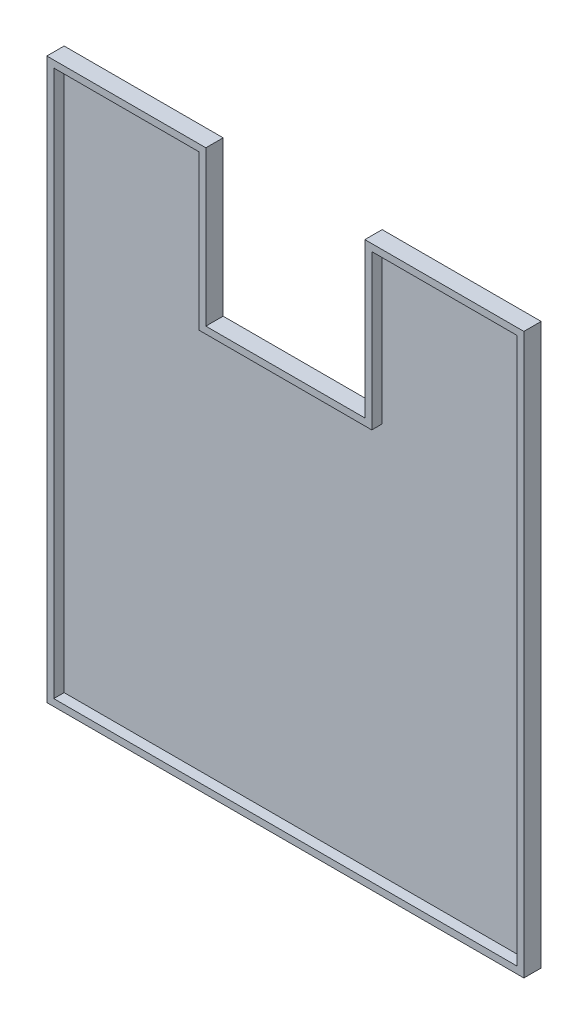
ISO-10303-21;
HEADER;
FILE_DESCRIPTION(('STEP AP214'),'2;1');
FILE_NAME('part.step','',(''),(''),'','','');
FILE_SCHEMA(('AUTOMOTIVE_DESIGN { 1 0 10303 214 1 1 1 1 }'));
ENDSEC;
DATA;
#1=APPLICATION_CONTEXT('core data for automotive mechanical design processes');
#2=APPLICATION_PROTOCOL_DEFINITION('international standard','automotive_design',2000,#1);
#3=PRODUCT_CONTEXT('',#1,'mechanical');
#4=PRODUCT('Part','Part','',(#3));
#5=PRODUCT_RELATED_PRODUCT_CATEGORY('part','',(#4));
#6=PRODUCT_DEFINITION_FORMATION('','',#4);
#7=PRODUCT_DEFINITION_CONTEXT('part definition',#1,'design');
#8=PRODUCT_DEFINITION('design','',#6,#7);
#9=PRODUCT_DEFINITION_SHAPE('','',#8);
#10=(LENGTH_UNIT() NAMED_UNIT(*) SI_UNIT(.MILLI.,.METRE.));
#11=(NAMED_UNIT(*) PLANE_ANGLE_UNIT() SI_UNIT($,.RADIAN.));
#12=(NAMED_UNIT(*) SI_UNIT($,.STERADIAN.) SOLID_ANGLE_UNIT());
#13=UNCERTAINTY_MEASURE_WITH_UNIT(LENGTH_MEASURE(1.E-05),#10,'distance_accuracy_value','');
#14=(GEOMETRIC_REPRESENTATION_CONTEXT(3) GLOBAL_UNCERTAINTY_ASSIGNED_CONTEXT((#13)) GLOBAL_UNIT_ASSIGNED_CONTEXT((#10,
#11,#12)) REPRESENTATION_CONTEXT('',''));
#15=CARTESIAN_POINT('',(0.,0.,0.));
#16=DIRECTION('',(0.,0.,1.));
#17=DIRECTION('',(1.,0.,0.));
#18=AXIS2_PLACEMENT_3D('',#15,#16,#17);
#19=CARTESIAN_POINT('',(0.,0.,0.));
#20=DIRECTION('',(0.,0.,1.));
#21=DIRECTION('',(1.,0.,0.));
#22=AXIS2_PLACEMENT_3D('',#19,#20,#21);
#23=PLANE('',#22);
#24=DIRECTION('',(-1.,0.,0.));
#25=VECTOR('',#24,1.);
#26=CARTESIAN_POINT('',(-23.,81.,0.));
#27=LINE('',#26,#25);
#28=CARTESIAN_POINT('',(-23.,81.,0.));
#29=VERTEX_POINT('',#28);
#30=CARTESIAN_POINT('',(-69.,81.,0.));
#31=VERTEX_POINT('',#30);
#32=EDGE_CURVE('E212',#29,#31,#27,.T.);
#33=ORIENTED_EDGE('',*,*,#32,.F.);
#34=DIRECTION('',(0.,1.,0.));
#35=VECTOR('',#34,1.);
#36=CARTESIAN_POINT('',(-23.,36.311907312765,0.));
#37=LINE('',#36,#35);
#38=CARTESIAN_POINT('',(-23.,36.311907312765,0.));
#39=VERTEX_POINT('',#38);
#40=EDGE_CURVE('E243',#39,#29,#37,.T.);
#41=ORIENTED_EDGE('',*,*,#40,.F.);
#42=DIRECTION('',(-1.,0.,0.));
#43=VECTOR('',#42,1.);
#44=CARTESIAN_POINT('',(23.,36.311907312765,0.));
#45=LINE('',#44,#43);
#46=CARTESIAN_POINT('',(23.,36.311907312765,0.));
#47=VERTEX_POINT('',#46);
#48=EDGE_CURVE('E240',#47,#39,#45,.T.);
#49=ORIENTED_EDGE('',*,*,#48,.F.);
#50=DIRECTION('',(0.,-1.,0.));
#51=VECTOR('',#50,1.);
#52=CARTESIAN_POINT('',(23.,81.,0.));
#53=LINE('',#52,#51);
#54=CARTESIAN_POINT('',(23.,81.,0.));
#55=VERTEX_POINT('',#54);
#56=EDGE_CURVE('E237',#55,#47,#53,.T.);
#57=ORIENTED_EDGE('',*,*,#56,.F.);
#58=DIRECTION('',(-1.,0.,0.));
#59=VECTOR('',#58,1.);
#60=CARTESIAN_POINT('',(69.,81.,0.));
#61=LINE('',#60,#59);
#62=CARTESIAN_POINT('',(69.,81.,0.));
#63=VERTEX_POINT('',#62);
#64=EDGE_CURVE('E234',#63,#55,#61,.T.);
#65=ORIENTED_EDGE('',*,*,#64,.F.);
#66=DIRECTION('',(0.,1.,0.));
#67=VECTOR('',#66,1.);
#68=CARTESIAN_POINT('',(69.,-81.,0.));
#69=LINE('',#68,#67);
#70=CARTESIAN_POINT('',(69.,-81.,0.));
#71=VERTEX_POINT('',#70);
#72=EDGE_CURVE('E231',#71,#63,#69,.T.);
#73=ORIENTED_EDGE('',*,*,#72,.F.);
#74=DIRECTION('',(1.,0.,0.));
#75=VECTOR('',#74,1.);
#76=CARTESIAN_POINT('',(-69.,-81.,0.));
#77=LINE('',#76,#75);
#78=CARTESIAN_POINT('',(-69.,-81.,0.));
#79=VERTEX_POINT('',#78);
#80=EDGE_CURVE('E228',#79,#71,#77,.T.);
#81=ORIENTED_EDGE('',*,*,#80,.F.);
#82=DIRECTION('',(0.,-1.,0.));
#83=VECTOR('',#82,1.);
#84=CARTESIAN_POINT('',(-69.,81.,0.));
#85=LINE('',#84,#83);
#86=EDGE_CURVE('E225',#31,#79,#85,.T.);
#87=ORIENTED_EDGE('',*,*,#86,.F.);
#88=EDGE_LOOP('',(#33,#41,#49,#57,#65,#73,#81,#87));
#89=FACE_BOUND('',#88,.T.);
#90=ADVANCED_FACE('F39',(#89),#23,.F.);
#91=CARTESIAN_POINT('',(-23.,36.311907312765,0.));
#92=DIRECTION('',(1.,0.,0.));
#93=DIRECTION('',(0.,0.,-1.));
#94=AXIS2_PLACEMENT_3D('',#91,#92,#93);
#95=PLANE('',#94);
#96=DIRECTION('',(0.,0.,1.));
#97=VECTOR('',#96,1.);
#98=CARTESIAN_POINT('',(-23.,81.,0.));
#99=LINE('',#98,#97);
#100=CARTESIAN_POINT('',(-23.,81.,5.));
#101=VERTEX_POINT('',#100);
#102=EDGE_CURVE('E247',#29,#101,#99,.T.);
#103=ORIENTED_EDGE('',*,*,#102,.T.);
#104=DIRECTION('',(0.,1.,0.));
#105=VECTOR('',#104,1.);
#106=CARTESIAN_POINT('',(-23.,36.311907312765,5.));
#107=LINE('',#106,#105);
#108=CARTESIAN_POINT('',(-23.,36.311907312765,5.));
#109=VERTEX_POINT('',#108);
#110=EDGE_CURVE('E157',#109,#101,#107,.T.);
#111=ORIENTED_EDGE('',*,*,#110,.F.);
#112=DIRECTION('',(0.,0.,1.));
#113=VECTOR('',#112,1.);
#114=CARTESIAN_POINT('',(-23.,36.311907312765,0.));
#115=LINE('',#114,#113);
#116=EDGE_CURVE('E250',#39,#109,#115,.T.);
#117=ORIENTED_EDGE('',*,*,#116,.F.);
#118=ORIENTED_EDGE('',*,*,#40,.T.);
#119=EDGE_LOOP('',(#103,#111,#117,#118));
#120=FACE_BOUND('',#119,.T.);
#121=ADVANCED_FACE('F307',(#120),#95,.T.);
#122=CARTESIAN_POINT('',(23.,36.311907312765,0.));
#123=DIRECTION('',(0.,1.,0.));
#124=DIRECTION('',(-1.,0.,0.));
#125=AXIS2_PLACEMENT_3D('',#122,#123,#124);
#126=PLANE('',#125);
#127=ORIENTED_EDGE('',*,*,#116,.T.);
#128=DIRECTION('',(-1.,0.,0.));
#129=VECTOR('',#128,1.);
#130=CARTESIAN_POINT('',(23.,36.311907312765,5.));
#131=LINE('',#130,#129);
#132=CARTESIAN_POINT('',(23.,36.311907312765,5.));
#133=VERTEX_POINT('',#132);
#134=EDGE_CURVE('E206',#133,#109,#131,.T.);
#135=ORIENTED_EDGE('',*,*,#134,.F.);
#136=DIRECTION('',(0.,0.,1.));
#137=VECTOR('',#136,1.);
#138=CARTESIAN_POINT('',(23.,36.311907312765,0.));
#139=LINE('',#138,#137);
#140=EDGE_CURVE('E252',#47,#133,#139,.T.);
#141=ORIENTED_EDGE('',*,*,#140,.F.);
#142=ORIENTED_EDGE('',*,*,#48,.T.);
#143=EDGE_LOOP('',(#127,#135,#141,#142));
#144=FACE_BOUND('',#143,.T.);
#145=ADVANCED_FACE('F312',(#144),#126,.T.);
#146=CARTESIAN_POINT('',(23.,81.,0.));
#147=DIRECTION('',(-1.,0.,0.));
#148=DIRECTION('',(0.,-1.,0.));
#149=AXIS2_PLACEMENT_3D('',#146,#147,#148);
#150=PLANE('',#149);
#151=ORIENTED_EDGE('',*,*,#140,.T.);
#152=DIRECTION('',(0.,-1.,0.));
#153=VECTOR('',#152,1.);
#154=CARTESIAN_POINT('',(23.,81.,5.));
#155=LINE('',#154,#153);
#156=CARTESIAN_POINT('',(23.,81.,5.));
#157=VERTEX_POINT('',#156);
#158=EDGE_CURVE('E203',#157,#133,#155,.T.);
#159=ORIENTED_EDGE('',*,*,#158,.F.);
#160=DIRECTION('',(0.,0.,1.));
#161=VECTOR('',#160,1.);
#162=CARTESIAN_POINT('',(23.,81.,0.));
#163=LINE('',#162,#161);
#164=EDGE_CURVE('E254',#55,#157,#163,.T.);
#165=ORIENTED_EDGE('',*,*,#164,.F.);
#166=ORIENTED_EDGE('',*,*,#56,.T.);
#167=EDGE_LOOP('',(#151,#159,#165,#166));
#168=FACE_BOUND('',#167,.T.);
#169=ADVANCED_FACE('F328',(#168),#150,.T.);
#170=CARTESIAN_POINT('',(69.,81.,0.));
#171=DIRECTION('',(0.,1.,0.));
#172=DIRECTION('',(0.,0.,1.));
#173=AXIS2_PLACEMENT_3D('',#170,#171,#172);
#174=PLANE('',#173);
#175=ORIENTED_EDGE('',*,*,#164,.T.);
#176=DIRECTION('',(-1.,0.,0.));
#177=VECTOR('',#176,1.);
#178=CARTESIAN_POINT('',(69.,81.,5.));
#179=LINE('',#178,#177);
#180=CARTESIAN_POINT('',(69.,81.,5.));
#181=VERTEX_POINT('',#180);
#182=EDGE_CURVE('E200',#181,#157,#179,.T.);
#183=ORIENTED_EDGE('',*,*,#182,.F.);
#184=DIRECTION('',(0.,0.,1.));
#185=VECTOR('',#184,1.);
#186=CARTESIAN_POINT('',(69.,81.,0.));
#187=LINE('',#186,#185);
#188=EDGE_CURVE('E256',#63,#181,#187,.T.);
#189=ORIENTED_EDGE('',*,*,#188,.F.);
#190=ORIENTED_EDGE('',*,*,#64,.T.);
#191=EDGE_LOOP('',(#175,#183,#189,#190));
#192=FACE_BOUND('',#191,.T.);
#193=ADVANCED_FACE('F332',(#192),#174,.T.);
#194=CARTESIAN_POINT('',(69.,-81.,0.));
#195=DIRECTION('',(1.,0.,0.));
#196=DIRECTION('',(0.,1.,0.));
#197=AXIS2_PLACEMENT_3D('',#194,#195,#196);
#198=PLANE('',#197);
#199=ORIENTED_EDGE('',*,*,#188,.T.);
#200=DIRECTION('',(0.,1.,0.));
#201=VECTOR('',#200,1.);
#202=CARTESIAN_POINT('',(69.,-81.,5.));
#203=LINE('',#202,#201);
#204=CARTESIAN_POINT('',(69.,-81.,5.));
#205=VERTEX_POINT('',#204);
#206=EDGE_CURVE('E197',#205,#181,#203,.T.);
#207=ORIENTED_EDGE('',*,*,#206,.F.);
#208=DIRECTION('',(0.,0.,1.));
#209=VECTOR('',#208,1.);
#210=CARTESIAN_POINT('',(69.,-81.,0.));
#211=LINE('',#210,#209);
#212=EDGE_CURVE('E258',#71,#205,#211,.T.);
#213=ORIENTED_EDGE('',*,*,#212,.F.);
#214=ORIENTED_EDGE('',*,*,#72,.T.);
#215=EDGE_LOOP('',(#199,#207,#213,#214));
#216=FACE_BOUND('',#215,.T.);
#217=ADVANCED_FACE('F337',(#216),#198,.T.);
#218=CARTESIAN_POINT('',(-69.,-81.,0.));
#219=DIRECTION('',(0.,-1.,0.));
#220=DIRECTION('',(0.,0.,-1.));
#221=AXIS2_PLACEMENT_3D('',#218,#219,#220);
#222=PLANE('',#221);
#223=ORIENTED_EDGE('',*,*,#212,.T.);
#224=DIRECTION('',(1.,0.,0.));
#225=VECTOR('',#224,1.);
#226=CARTESIAN_POINT('',(-69.,-81.,5.));
#227=LINE('',#226,#225);
#228=CARTESIAN_POINT('',(-69.,-81.,5.));
#229=VERTEX_POINT('',#228);
#230=EDGE_CURVE('E194',#229,#205,#227,.T.);
#231=ORIENTED_EDGE('',*,*,#230,.F.);
#232=DIRECTION('',(0.,0.,1.));
#233=VECTOR('',#232,1.);
#234=CARTESIAN_POINT('',(-69.,-81.,0.));
#235=LINE('',#234,#233);
#236=EDGE_CURVE('E260',#79,#229,#235,.T.);
#237=ORIENTED_EDGE('',*,*,#236,.F.);
#238=ORIENTED_EDGE('',*,*,#80,.T.);
#239=EDGE_LOOP('',(#223,#231,#237,#238));
#240=FACE_BOUND('',#239,.T.);
#241=ADVANCED_FACE('F340',(#240),#222,.T.);
#242=CARTESIAN_POINT('',(-69.,81.,0.));
#243=DIRECTION('',(-1.,0.,0.));
#244=DIRECTION('',(0.,-1.,0.));
#245=AXIS2_PLACEMENT_3D('',#242,#243,#244);
#246=PLANE('',#245);
#247=ORIENTED_EDGE('',*,*,#236,.T.);
#248=DIRECTION('',(0.,-1.,0.));
#249=VECTOR('',#248,1.);
#250=CARTESIAN_POINT('',(-69.,81.,5.));
#251=LINE('',#250,#249);
#252=CARTESIAN_POINT('',(-69.,81.,5.));
#253=VERTEX_POINT('',#252);
#254=EDGE_CURVE('E191',#253,#229,#251,.T.);
#255=ORIENTED_EDGE('',*,*,#254,.F.);
#256=DIRECTION('',(0.,0.,1.));
#257=VECTOR('',#256,1.);
#258=CARTESIAN_POINT('',(-69.,81.,0.));
#259=LINE('',#258,#257);
#260=EDGE_CURVE('E246',#31,#253,#259,.T.);
#261=ORIENTED_EDGE('',*,*,#260,.F.);
#262=ORIENTED_EDGE('',*,*,#86,.T.);
#263=EDGE_LOOP('',(#247,#255,#261,#262));
#264=FACE_BOUND('',#263,.T.);
#265=ADVANCED_FACE('F343',(#264),#246,.T.);
#266=CARTESIAN_POINT('',(-27.,81.,0.));
#267=DIRECTION('',(0.,1.,0.));
#268=DIRECTION('',(0.,0.,1.));
#269=AXIS2_PLACEMENT_3D('',#266,#267,#268);
#270=PLANE('',#269);
#271=ORIENTED_EDGE('',*,*,#260,.T.);
#272=DIRECTION('',(-1.,0.,0.));
#273=VECTOR('',#272,1.);
#274=CARTESIAN_POINT('',(-23.,81.,5.));
#275=LINE('',#274,#273);
#276=EDGE_CURVE('E188',#101,#253,#275,.T.);
#277=ORIENTED_EDGE('',*,*,#276,.F.);
#278=ORIENTED_EDGE('',*,*,#102,.F.);
#279=ORIENTED_EDGE('',*,*,#32,.T.);
#280=EDGE_LOOP('',(#271,#277,#278,#279));
#281=FACE_BOUND('',#280,.T.);
#282=ADVANCED_FACE('F345',(#281),#270,.T.);
#283=CARTESIAN_POINT('',(-25.,34.510337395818,0.));
#284=DIRECTION('',(1.,3.49689613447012E-13,0.));
#285=DIRECTION('',(-3.49689613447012E-13,1.,0.));
#286=AXIS2_PLACEMENT_3D('',#283,#284,#285);
#287=PLANE('',#286);
#288=DIRECTION('',(0.,1.,0.));
#289=VECTOR('',#288,1.);
#290=CARTESIAN_POINT('',(-25.,79.,2.));
#291=LINE('',#290,#289);
#292=CARTESIAN_POINT('',(-24.9999999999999,34.311907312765,2.));
#293=VERTEX_POINT('',#292);
#294=CARTESIAN_POINT('',(-25.,79.,2.));
#295=VERTEX_POINT('',#294);
#296=EDGE_CURVE('E61',#293,#295,#291,.T.);
#297=ORIENTED_EDGE('',*,*,#296,.F.);
#298=DIRECTION('',(0.,0.,1.));
#299=VECTOR('',#298,1.);
#300=CARTESIAN_POINT('',(-24.9999999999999,34.311907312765,0.));
#301=LINE('',#300,#299);
#302=CARTESIAN_POINT('',(-24.9999999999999,34.311907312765,5.));
#303=VERTEX_POINT('',#302);
#304=EDGE_CURVE('E162',#293,#303,#301,.T.);
#305=ORIENTED_EDGE('',*,*,#304,.T.);
#306=DIRECTION('',(0.,1.,0.));
#307=VECTOR('',#306,1.);
#308=CARTESIAN_POINT('',(-25.,34.510337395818,5.));
#309=LINE('',#308,#307);
#310=CARTESIAN_POINT('',(-25.,79.,5.));
#311=VERTEX_POINT('',#310);
#312=EDGE_CURVE('E160',#303,#311,#309,.T.);
#313=ORIENTED_EDGE('',*,*,#312,.T.);
#314=DIRECTION('',(0.,0.,1.));
#315=VECTOR('',#314,1.);
#316=CARTESIAN_POINT('',(-25.,79.,0.));
#317=LINE('',#316,#315);
#318=EDGE_CURVE('E149',#295,#311,#317,.T.);
#319=ORIENTED_EDGE('',*,*,#318,.F.);
#320=EDGE_LOOP('',(#297,#305,#313,#319));
#321=FACE_BOUND('',#320,.T.);
#322=ADVANCED_FACE('F161',(#321),#287,.F.);
#323=CARTESIAN_POINT('',(-24.9999999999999,34.311907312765,0.));
#324=DIRECTION('',(0.,1.,0.));
#325=DIRECTION('',(0.,0.,1.));
#326=AXIS2_PLACEMENT_3D('',#323,#324,#325);
#327=PLANE('',#326);
#328=DIRECTION('',(-1.,0.,0.));
#329=VECTOR('',#328,1.);
#330=CARTESIAN_POINT('',(0.,34.311907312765,2.));
#331=LINE('',#330,#329);
#332=CARTESIAN_POINT('',(25.0000000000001,34.311907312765,2.));
#333=VERTEX_POINT('',#332);
#334=EDGE_CURVE('E249',#333,#293,#331,.T.);
#335=ORIENTED_EDGE('',*,*,#334,.F.);
#336=DIRECTION('',(0.,0.,1.));
#337=VECTOR('',#336,1.);
#338=CARTESIAN_POINT('',(25.0000000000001,34.311907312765,0.));
#339=LINE('',#338,#337);
#340=CARTESIAN_POINT('',(25.0000000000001,34.311907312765,5.));
#341=VERTEX_POINT('',#340);
#342=EDGE_CURVE('E213',#333,#341,#339,.T.);
#343=ORIENTED_EDGE('',*,*,#342,.T.);
#344=DIRECTION('',(-1.,0.,0.));
#345=VECTOR('',#344,1.);
#346=CARTESIAN_POINT('',(-24.9999999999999,34.311907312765,5.));
#347=LINE('',#346,#345);
#348=EDGE_CURVE('E186',#341,#303,#347,.T.);
#349=ORIENTED_EDGE('',*,*,#348,.T.);
#350=ORIENTED_EDGE('',*,*,#304,.F.);
#351=EDGE_LOOP('',(#335,#343,#349,#350));
#352=FACE_BOUND('',#351,.T.);
#353=ADVANCED_FACE('F296',(#352),#327,.F.);
#354=CARTESIAN_POINT('',(25.0000000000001,34.311907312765,0.));
#355=DIRECTION('',(-1.,-3.49689613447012E-13,0.));
#356=DIRECTION('',(3.49689613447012E-13,-1.,0.));
#357=AXIS2_PLACEMENT_3D('',#354,#355,#356);
#358=PLANE('',#357);
#359=DIRECTION('',(0.,-1.,0.));
#360=VECTOR('',#359,1.);
#361=CARTESIAN_POINT('',(25.,34.510337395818,2.));
#362=LINE('',#361,#360);
#363=CARTESIAN_POINT('',(25.,79.,2.));
#364=VERTEX_POINT('',#363);
#365=EDGE_CURVE('E268',#364,#333,#362,.T.);
#366=ORIENTED_EDGE('',*,*,#365,.F.);
#367=DIRECTION('',(0.,0.,1.));
#368=VECTOR('',#367,1.);
#369=CARTESIAN_POINT('',(25.,79.,0.));
#370=LINE('',#369,#368);
#371=CARTESIAN_POINT('',(25.,79.,5.));
#372=VERTEX_POINT('',#371);
#373=EDGE_CURVE('E215',#364,#372,#370,.T.);
#374=ORIENTED_EDGE('',*,*,#373,.T.);
#375=DIRECTION('',(0.,-1.,0.));
#376=VECTOR('',#375,1.);
#377=CARTESIAN_POINT('',(25.,79.,5.));
#378=LINE('',#377,#376);
#379=EDGE_CURVE('E183',#372,#341,#378,.T.);
#380=ORIENTED_EDGE('',*,*,#379,.T.);
#381=ORIENTED_EDGE('',*,*,#342,.F.);
#382=EDGE_LOOP('',(#366,#374,#380,#381));
#383=FACE_BOUND('',#382,.T.);
#384=ADVANCED_FACE('F297',(#383),#358,.F.);
#385=CARTESIAN_POINT('',(67.,79.,0.));
#386=DIRECTION('',(0.,1.,0.));
#387=DIRECTION('',(0.,0.,1.));
#388=AXIS2_PLACEMENT_3D('',#385,#386,#387);
#389=PLANE('',#388);
#390=DIRECTION('',(-1.,0.,0.));
#391=VECTOR('',#390,1.);
#392=CARTESIAN_POINT('',(25.,79.,2.));
#393=LINE('',#392,#391);
#394=CARTESIAN_POINT('',(67.,79.,2.));
#395=VERTEX_POINT('',#394);
#396=EDGE_CURVE('E265',#395,#364,#393,.T.);
#397=ORIENTED_EDGE('',*,*,#396,.F.);
#398=DIRECTION('',(0.,0.,1.));
#399=VECTOR('',#398,1.);
#400=CARTESIAN_POINT('',(67.,79.,0.));
#401=LINE('',#400,#399);
#402=CARTESIAN_POINT('',(67.,79.,5.));
#403=VERTEX_POINT('',#402);
#404=EDGE_CURVE('E217',#395,#403,#401,.T.);
#405=ORIENTED_EDGE('',*,*,#404,.T.);
#406=DIRECTION('',(-1.,0.,0.));
#407=VECTOR('',#406,1.);
#408=CARTESIAN_POINT('',(67.,79.,5.));
#409=LINE('',#408,#407);
#410=EDGE_CURVE('E180',#403,#372,#409,.T.);
#411=ORIENTED_EDGE('',*,*,#410,.T.);
#412=ORIENTED_EDGE('',*,*,#373,.F.);
#413=EDGE_LOOP('',(#397,#405,#411,#412));
#414=FACE_BOUND('',#413,.T.);
#415=ADVANCED_FACE('F290',(#414),#389,.F.);
#416=CARTESIAN_POINT('',(67.,-79.,0.));
#417=DIRECTION('',(1.,0.,0.));
#418=DIRECTION('',(0.,0.,-1.));
#419=AXIS2_PLACEMENT_3D('',#416,#417,#418);
#420=PLANE('',#419);
#421=DIRECTION('',(0.,1.,0.));
#422=VECTOR('',#421,1.);
#423=CARTESIAN_POINT('',(67.,-79.,2.));
#424=LINE('',#423,#422);
#425=CARTESIAN_POINT('',(67.,-79.,2.));
#426=VERTEX_POINT('',#425);
#427=EDGE_CURVE('E11',#426,#395,#424,.T.);
#428=ORIENTED_EDGE('',*,*,#427,.F.);
#429=DIRECTION('',(0.,0.,1.));
#430=VECTOR('',#429,1.);
#431=CARTESIAN_POINT('',(67.,-79.,0.));
#432=LINE('',#431,#430);
#433=CARTESIAN_POINT('',(67.,-79.,5.));
#434=VERTEX_POINT('',#433);
#435=EDGE_CURVE('E219',#426,#434,#432,.T.);
#436=ORIENTED_EDGE('',*,*,#435,.T.);
#437=DIRECTION('',(0.,1.,0.));
#438=VECTOR('',#437,1.);
#439=CARTESIAN_POINT('',(67.,-79.,5.));
#440=LINE('',#439,#438);
#441=EDGE_CURVE('E177',#434,#403,#440,.T.);
#442=ORIENTED_EDGE('',*,*,#441,.T.);
#443=ORIENTED_EDGE('',*,*,#404,.F.);
#444=EDGE_LOOP('',(#428,#436,#442,#443));
#445=FACE_BOUND('',#444,.T.);
#446=ADVANCED_FACE('F288',(#445),#420,.F.);
#447=CARTESIAN_POINT('',(-67.,-79.,0.));
#448=DIRECTION('',(0.,-1.,0.));
#449=DIRECTION('',(0.,0.,-1.));
#450=AXIS2_PLACEMENT_3D('',#447,#448,#449);
#451=PLANE('',#450);
#452=DIRECTION('',(1.,0.,0.));
#453=VECTOR('',#452,1.);
#454=CARTESIAN_POINT('',(-67.,-79.,2.));
#455=LINE('',#454,#453);
#456=CARTESIAN_POINT('',(-67.,-79.,2.));
#457=VERTEX_POINT('',#456);
#458=EDGE_CURVE('E46',#457,#426,#455,.T.);
#459=ORIENTED_EDGE('',*,*,#458,.F.);
#460=DIRECTION('',(0.,0.,1.));
#461=VECTOR('',#460,1.);
#462=CARTESIAN_POINT('',(-67.,-79.,0.));
#463=LINE('',#462,#461);
#464=CARTESIAN_POINT('',(-67.,-79.,5.));
#465=VERTEX_POINT('',#464);
#466=EDGE_CURVE('E221',#457,#465,#463,.T.);
#467=ORIENTED_EDGE('',*,*,#466,.T.);
#468=DIRECTION('',(1.,0.,0.));
#469=VECTOR('',#468,1.);
#470=CARTESIAN_POINT('',(-67.,-79.,5.));
#471=LINE('',#470,#469);
#472=EDGE_CURVE('E172',#465,#434,#471,.T.);
#473=ORIENTED_EDGE('',*,*,#472,.T.);
#474=ORIENTED_EDGE('',*,*,#435,.F.);
#475=EDGE_LOOP('',(#459,#467,#473,#474));
#476=FACE_BOUND('',#475,.T.);
#477=ADVANCED_FACE('F280',(#476),#451,.F.);
#478=CARTESIAN_POINT('',(-67.,79.,0.));
#479=DIRECTION('',(-1.,0.,0.));
#480=DIRECTION('',(0.,0.,1.));
#481=AXIS2_PLACEMENT_3D('',#478,#479,#480);
#482=PLANE('',#481);
#483=DIRECTION('',(0.,-1.,0.));
#484=VECTOR('',#483,1.);
#485=CARTESIAN_POINT('',(-67.,-79.,2.));
#486=LINE('',#485,#484);
#487=CARTESIAN_POINT('',(-67.,79.,2.));
#488=VERTEX_POINT('',#487);
#489=EDGE_CURVE('E272',#488,#457,#486,.T.);
#490=ORIENTED_EDGE('',*,*,#489,.F.);
#491=DIRECTION('',(0.,0.,1.));
#492=VECTOR('',#491,1.);
#493=CARTESIAN_POINT('',(-67.,79.,0.));
#494=LINE('',#493,#492);
#495=CARTESIAN_POINT('',(-67.,79.,5.));
#496=VERTEX_POINT('',#495);
#497=EDGE_CURVE('E53',#488,#496,#494,.T.);
#498=ORIENTED_EDGE('',*,*,#497,.T.);
#499=DIRECTION('',(0.,-1.,0.));
#500=VECTOR('',#499,1.);
#501=CARTESIAN_POINT('',(-67.,79.,5.));
#502=LINE('',#501,#500);
#503=EDGE_CURVE('E170',#496,#465,#502,.T.);
#504=ORIENTED_EDGE('',*,*,#503,.T.);
#505=ORIENTED_EDGE('',*,*,#466,.F.);
#506=EDGE_LOOP('',(#490,#498,#504,#505));
#507=FACE_BOUND('',#506,.T.);
#508=ADVANCED_FACE('F282',(#507),#482,.F.);
#509=CARTESIAN_POINT('',(-25.,79.,0.));
#510=DIRECTION('',(0.,1.,0.));
#511=DIRECTION('',(0.,0.,1.));
#512=AXIS2_PLACEMENT_3D('',#509,#510,#511);
#513=PLANE('',#512);
#514=DIRECTION('',(-1.,0.,0.));
#515=VECTOR('',#514,1.);
#516=CARTESIAN_POINT('',(-67.,79.,2.));
#517=LINE('',#516,#515);
#518=EDGE_CURVE('E156',#295,#488,#517,.T.);
#519=ORIENTED_EDGE('',*,*,#518,.F.);
#520=ORIENTED_EDGE('',*,*,#318,.T.);
#521=DIRECTION('',(-1.,0.,0.));
#522=VECTOR('',#521,1.);
#523=CARTESIAN_POINT('',(-25.,79.,5.));
#524=LINE('',#523,#522);
#525=EDGE_CURVE('E153',#311,#496,#524,.T.);
#526=ORIENTED_EDGE('',*,*,#525,.T.);
#527=ORIENTED_EDGE('',*,*,#497,.F.);
#528=EDGE_LOOP('',(#519,#520,#526,#527));
#529=FACE_BOUND('',#528,.T.);
#530=ADVANCED_FACE('F151',(#529),#513,.F.);
#531=CARTESIAN_POINT('',(0.,0.,5.));
#532=DIRECTION('',(0.,0.,1.));
#533=DIRECTION('',(1.,0.,0.));
#534=AXIS2_PLACEMENT_3D('',#531,#532,#533);
#535=PLANE('',#534);
#536=ORIENTED_EDGE('',*,*,#276,.T.);
#537=ORIENTED_EDGE('',*,*,#254,.T.);
#538=ORIENTED_EDGE('',*,*,#230,.T.);
#539=ORIENTED_EDGE('',*,*,#206,.T.);
#540=ORIENTED_EDGE('',*,*,#182,.T.);
#541=ORIENTED_EDGE('',*,*,#158,.T.);
#542=ORIENTED_EDGE('',*,*,#134,.T.);
#543=ORIENTED_EDGE('',*,*,#110,.T.);
#544=EDGE_LOOP('',(#536,#537,#538,#539,#540,#541,#542,#543));
#545=FACE_BOUND('',#544,.T.);
#546=ORIENTED_EDGE('',*,*,#503,.F.);
#547=ORIENTED_EDGE('',*,*,#525,.F.);
#548=ORIENTED_EDGE('',*,*,#312,.F.);
#549=ORIENTED_EDGE('',*,*,#348,.F.);
#550=ORIENTED_EDGE('',*,*,#379,.F.);
#551=ORIENTED_EDGE('',*,*,#410,.F.);
#552=ORIENTED_EDGE('',*,*,#441,.F.);
#553=ORIENTED_EDGE('',*,*,#472,.F.);
#554=EDGE_LOOP('',(#546,#547,#548,#549,#550,#551,#552,#553));
#555=FACE_BOUND('',#554,.T.);
#556=ADVANCED_FACE('F167',(#545,#555),#535,.T.);
#557=CARTESIAN_POINT('',(0.,0.,2.));
#558=DIRECTION('',(0.,0.,1.));
#559=DIRECTION('',(1.,0.,0.));
#560=AXIS2_PLACEMENT_3D('',#557,#558,#559);
#561=PLANE('',#560);
#562=ORIENTED_EDGE('',*,*,#334,.T.);
#563=ORIENTED_EDGE('',*,*,#296,.T.);
#564=ORIENTED_EDGE('',*,*,#518,.T.);
#565=ORIENTED_EDGE('',*,*,#489,.T.);
#566=ORIENTED_EDGE('',*,*,#458,.T.);
#567=ORIENTED_EDGE('',*,*,#427,.T.);
#568=ORIENTED_EDGE('',*,*,#396,.T.);
#569=ORIENTED_EDGE('',*,*,#365,.T.);
#570=EDGE_LOOP('',(#562,#563,#564,#565,#566,#567,#568,#569));
#571=FACE_BOUND('',#570,.T.);
#572=ADVANCED_FACE('F276',(#571),#561,.T.);
#573=CLOSED_SHELL('',(#90,#121,#145,#169,#193,#217,#241,#265,#282,#322,#353,#384,#415,#446,#477,
#508,#530,#556,#572));
#574=MANIFOLD_SOLID_BREP('B2',#573);
#575=ADVANCED_BREP_SHAPE_REPRESENTATION('',(#18,#574),#14);
#576=SHAPE_DEFINITION_REPRESENTATION(#9,#575);
ENDSEC;
END-ISO-10303-21;
